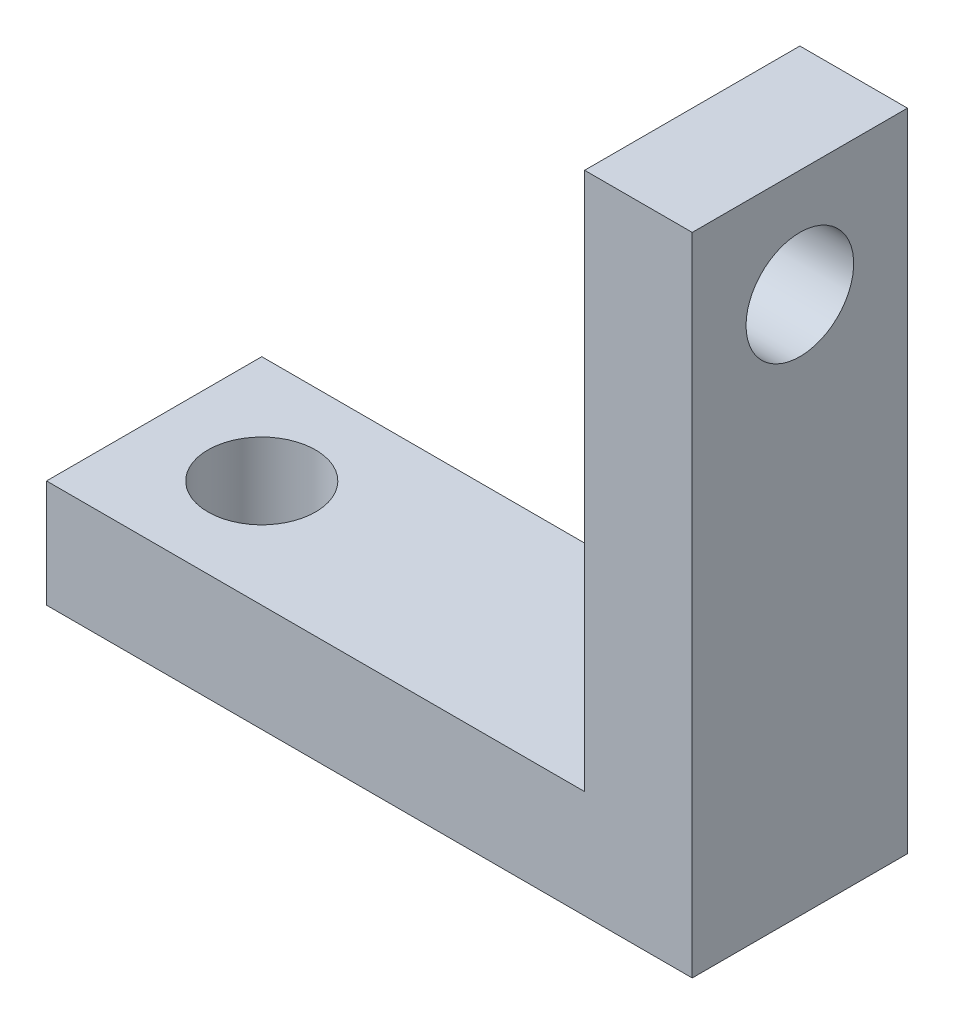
ISO-10303-21;
HEADER;
FILE_DESCRIPTION(('STEP AP214'),'2;1');
FILE_NAME('part.step','',(''),(''),'','','');
FILE_SCHEMA(('AUTOMOTIVE_DESIGN { 1 0 10303 214 1 1 1 1 }'));
ENDSEC;
DATA;
#1=APPLICATION_CONTEXT('core data for automotive mechanical design processes');
#2=APPLICATION_PROTOCOL_DEFINITION('international standard','automotive_design',2000,#1);
#3=PRODUCT_CONTEXT('',#1,'mechanical');
#4=PRODUCT('Part','Part','',(#3));
#5=PRODUCT_RELATED_PRODUCT_CATEGORY('part','',(#4));
#6=PRODUCT_DEFINITION_FORMATION('','',#4);
#7=PRODUCT_DEFINITION_CONTEXT('part definition',#1,'design');
#8=PRODUCT_DEFINITION('design','',#6,#7);
#9=PRODUCT_DEFINITION_SHAPE('','',#8);
#10=(LENGTH_UNIT() NAMED_UNIT(*) SI_UNIT(.MILLI.,.METRE.));
#11=(NAMED_UNIT(*) PLANE_ANGLE_UNIT() SI_UNIT($,.RADIAN.));
#12=(NAMED_UNIT(*) SI_UNIT($,.STERADIAN.) SOLID_ANGLE_UNIT());
#13=UNCERTAINTY_MEASURE_WITH_UNIT(LENGTH_MEASURE(1.E-05),#10,'distance_accuracy_value','');
#14=(GEOMETRIC_REPRESENTATION_CONTEXT(3) GLOBAL_UNCERTAINTY_ASSIGNED_CONTEXT((#13)) GLOBAL_UNIT_ASSIGNED_CONTEXT((#10,
#11,#12)) REPRESENTATION_CONTEXT('',''));
#15=CARTESIAN_POINT('',(0.,0.,0.));
#16=DIRECTION('',(0.,0.,1.));
#17=DIRECTION('',(1.,0.,0.));
#18=AXIS2_PLACEMENT_3D('',#15,#16,#17);
#19=CARTESIAN_POINT('',(-113.041016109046,-44.8276951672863,-38.1));
#20=DIRECTION('',(-1.,0.,0.));
#21=DIRECTION('',(0.,-1.,0.));
#22=AXIS2_PLACEMENT_3D('',#19,#20,#21);
#23=PLANE('',#22);
#24=DIRECTION('',(0.,-1.,0.));
#25=VECTOR('',#24,1.);
#26=CARTESIAN_POINT('',(-113.041016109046,-44.8276951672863,0.));
#27=LINE('',#26,#25);
#28=CARTESIAN_POINT('',(-113.041016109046,-44.8276951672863,0.));
#29=VERTEX_POINT('',#28);
#30=CARTESIAN_POINT('',(-113.041016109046,-63.8776951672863,0.));
#31=VERTEX_POINT('',#30);
#32=EDGE_CURVE('E401',#29,#31,#27,.T.);
#33=ORIENTED_EDGE('',*,*,#32,.F.);
#34=DIRECTION('',(0.,0.,1.));
#35=VECTOR('',#34,1.);
#36=CARTESIAN_POINT('',(-113.041016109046,-44.8276951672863,-38.1));
#37=LINE('',#36,#35);
#38=CARTESIAN_POINT('',(-113.041016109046,-44.8276951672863,-38.1));
#39=VERTEX_POINT('',#38);
#40=EDGE_CURVE('E11',#39,#29,#37,.T.);
#41=ORIENTED_EDGE('',*,*,#40,.F.);
#42=DIRECTION('',(0.,-1.,0.));
#43=VECTOR('',#42,1.);
#44=CARTESIAN_POINT('',(-113.041016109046,-44.8276951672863,-38.1));
#45=LINE('',#44,#43);
#46=CARTESIAN_POINT('',(-113.041016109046,-63.8776951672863,-38.1));
#47=VERTEX_POINT('',#46);
#48=EDGE_CURVE('E403',#39,#47,#45,.T.);
#49=ORIENTED_EDGE('',*,*,#48,.T.);
#50=DIRECTION('',(0.,0.,1.));
#51=VECTOR('',#50,1.);
#52=CARTESIAN_POINT('',(-113.041016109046,-63.8776951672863,-38.1));
#53=LINE('',#52,#51);
#54=EDGE_CURVE('E352',#47,#31,#53,.T.);
#55=ORIENTED_EDGE('',*,*,#54,.T.);
#56=EDGE_LOOP('',(#33,#41,#49,#55));
#57=FACE_BOUND('',#56,.T.);
#58=ADVANCED_FACE('F349',(#57),#23,.T.);
#59=CARTESIAN_POINT('',(-17.7910161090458,-44.8276951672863,-38.1));
#60=DIRECTION('',(0.,1.,0.));
#61=DIRECTION('',(-1.,0.,0.));
#62=AXIS2_PLACEMENT_3D('',#59,#60,#61);
#63=PLANE('',#62);
#64=CARTESIAN_POINT('',(-93.9910161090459,-44.8276951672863,-19.05));
#65=DIRECTION('',(0.,1.,0.));
#66=DIRECTION('',(0.,0.,1.));
#67=AXIS2_PLACEMENT_3D('',#64,#65,#66);
#68=CIRCLE('',#67,9.52500000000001);
#69=CARTESIAN_POINT('',(-93.9910161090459,-44.8276951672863,-9.52499999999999));
#70=VERTEX_POINT('',#69);
#71=EDGE_CURVE('E423',#70,#70,#68,.T.);
#72=ORIENTED_EDGE('',*,*,#71,.F.);
#73=EDGE_LOOP('',(#72));
#74=FACE_BOUND('',#73,.T.);
#75=DIRECTION('',(-1.,0.,0.));
#76=VECTOR('',#75,1.);
#77=CARTESIAN_POINT('',(-17.7910161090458,-44.8276951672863,0.));
#78=LINE('',#77,#76);
#79=CARTESIAN_POINT('',(-17.7910161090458,-44.8276951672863,0.));
#80=VERTEX_POINT('',#79);
#81=EDGE_CURVE('E419',#80,#29,#78,.T.);
#82=ORIENTED_EDGE('',*,*,#81,.F.);
#83=DIRECTION('',(0.,0.,1.));
#84=VECTOR('',#83,1.);
#85=CARTESIAN_POINT('',(-17.7910161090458,-44.8276951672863,-38.1));
#86=LINE('',#85,#84);
#87=CARTESIAN_POINT('',(-17.7910161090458,-44.8276951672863,-38.1));
#88=VERTEX_POINT('',#87);
#89=EDGE_CURVE('E357',#88,#80,#86,.T.);
#90=ORIENTED_EDGE('',*,*,#89,.F.);
#91=DIRECTION('',(-1.,0.,0.));
#92=VECTOR('',#91,1.);
#93=CARTESIAN_POINT('',(-17.7910161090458,-44.8276951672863,-38.1));
#94=LINE('',#93,#92);
#95=EDGE_CURVE('E408',#88,#39,#94,.T.);
#96=ORIENTED_EDGE('',*,*,#95,.T.);
#97=ORIENTED_EDGE('',*,*,#40,.T.);
#98=EDGE_LOOP('',(#82,#90,#96,#97));
#99=FACE_BOUND('',#98,.T.);
#100=ADVANCED_FACE('F459',(#74,#99),#63,.T.);
#101=CARTESIAN_POINT('',(-17.7910161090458,50.4223048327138,-38.1));
#102=DIRECTION('',(-1.,0.,0.));
#103=DIRECTION('',(0.,-1.,0.));
#104=AXIS2_PLACEMENT_3D('',#101,#102,#103);
#105=PLANE('',#104);
#106=CARTESIAN_POINT('',(-17.7910161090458,31.3723048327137,-19.05));
#107=DIRECTION('',(-1.,0.,0.));
#108=DIRECTION('',(0.,0.,1.));
#109=AXIS2_PLACEMENT_3D('',#106,#107,#108);
#110=CIRCLE('',#109,9.525);
#111=CARTESIAN_POINT('',(-17.7910161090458,31.3723048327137,-9.525));
#112=VERTEX_POINT('',#111);
#113=EDGE_CURVE('E533',#112,#112,#110,.T.);
#114=ORIENTED_EDGE('',*,*,#113,.F.);
#115=EDGE_LOOP('',(#114));
#116=FACE_BOUND('',#115,.T.);
#117=DIRECTION('',(0.,-1.,0.));
#118=VECTOR('',#117,1.);
#119=CARTESIAN_POINT('',(-17.7910161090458,50.4223048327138,0.));
#120=LINE('',#119,#118);
#121=CARTESIAN_POINT('',(-17.7910161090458,50.4223048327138,0.));
#122=VERTEX_POINT('',#121);
#123=EDGE_CURVE('E431',#122,#80,#120,.T.);
#124=ORIENTED_EDGE('',*,*,#123,.F.);
#125=DIRECTION('',(0.,0.,1.));
#126=VECTOR('',#125,1.);
#127=CARTESIAN_POINT('',(-17.7910161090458,50.4223048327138,-38.1));
#128=LINE('',#127,#126);
#129=CARTESIAN_POINT('',(-17.7910161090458,50.4223048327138,-38.1));
#130=VERTEX_POINT('',#129);
#131=EDGE_CURVE('E447',#130,#122,#128,.T.);
#132=ORIENTED_EDGE('',*,*,#131,.F.);
#133=DIRECTION('',(0.,-1.,0.));
#134=VECTOR('',#133,1.);
#135=CARTESIAN_POINT('',(-17.7910161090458,50.4223048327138,-38.1));
#136=LINE('',#135,#134);
#137=EDGE_CURVE('E443',#130,#88,#136,.T.);
#138=ORIENTED_EDGE('',*,*,#137,.T.);
#139=ORIENTED_EDGE('',*,*,#89,.T.);
#140=EDGE_LOOP('',(#124,#132,#138,#139));
#141=FACE_BOUND('',#140,.T.);
#142=ADVANCED_FACE('F464',(#116,#141),#105,.T.);
#143=CARTESIAN_POINT('',(1.25898389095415,50.4223048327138,-38.1));
#144=DIRECTION('',(0.,1.,0.));
#145=DIRECTION('',(-1.,0.,0.));
#146=AXIS2_PLACEMENT_3D('',#143,#144,#145);
#147=PLANE('',#146);
#148=DIRECTION('',(-1.,0.,0.));
#149=VECTOR('',#148,1.);
#150=CARTESIAN_POINT('',(1.25898389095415,50.4223048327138,0.));
#151=LINE('',#150,#149);
#152=CARTESIAN_POINT('',(1.25898389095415,50.4223048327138,0.));
#153=VERTEX_POINT('',#152);
#154=EDGE_CURVE('E428',#153,#122,#151,.T.);
#155=ORIENTED_EDGE('',*,*,#154,.F.);
#156=DIRECTION('',(0.,0.,1.));
#157=VECTOR('',#156,1.);
#158=CARTESIAN_POINT('',(1.25898389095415,50.4223048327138,-38.1));
#159=LINE('',#158,#157);
#160=CARTESIAN_POINT('',(1.25898389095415,50.4223048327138,-38.1));
#161=VERTEX_POINT('',#160);
#162=EDGE_CURVE('E449',#161,#153,#159,.T.);
#163=ORIENTED_EDGE('',*,*,#162,.F.);
#164=DIRECTION('',(-1.,0.,0.));
#165=VECTOR('',#164,1.);
#166=CARTESIAN_POINT('',(1.25898389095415,50.4223048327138,-38.1));
#167=LINE('',#166,#165);
#168=EDGE_CURVE('E440',#161,#130,#167,.T.);
#169=ORIENTED_EDGE('',*,*,#168,.T.);
#170=ORIENTED_EDGE('',*,*,#131,.T.);
#171=EDGE_LOOP('',(#155,#163,#169,#170));
#172=FACE_BOUND('',#171,.T.);
#173=ADVANCED_FACE('F456',(#172),#147,.T.);
#174=CARTESIAN_POINT('',(1.25898389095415,-63.8776951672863,-38.1));
#175=DIRECTION('',(1.,0.,0.));
#176=DIRECTION('',(0.,0.,-1.));
#177=AXIS2_PLACEMENT_3D('',#174,#175,#176);
#178=PLANE('',#177);
#179=CARTESIAN_POINT('',(1.25898389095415,31.3723048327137,-19.05));
#180=DIRECTION('',(-1.,0.,0.));
#181=DIRECTION('',(0.,0.,1.));
#182=AXIS2_PLACEMENT_3D('',#179,#180,#181);
#183=CIRCLE('',#182,9.525);
#184=CARTESIAN_POINT('',(1.25898389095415,31.3723048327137,-9.525));
#185=VERTEX_POINT('',#184);
#186=EDGE_CURVE('E532',#185,#185,#183,.T.);
#187=ORIENTED_EDGE('',*,*,#186,.T.);
#188=EDGE_LOOP('',(#187));
#189=FACE_BOUND('',#188,.T.);
#190=DIRECTION('',(0.,1.,0.));
#191=VECTOR('',#190,1.);
#192=CARTESIAN_POINT('',(1.25898389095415,-63.8776951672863,0.));
#193=LINE('',#192,#191);
#194=CARTESIAN_POINT('',(1.25898389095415,-63.8776951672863,0.));
#195=VERTEX_POINT('',#194);
#196=EDGE_CURVE('E415',#195,#153,#193,.T.);
#197=ORIENTED_EDGE('',*,*,#196,.F.);
#198=DIRECTION('',(0.,0.,1.));
#199=VECTOR('',#198,1.);
#200=CARTESIAN_POINT('',(1.25898389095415,-63.8776951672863,-38.1));
#201=LINE('',#200,#199);
#202=CARTESIAN_POINT('',(1.25898389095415,-63.8776951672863,-38.1));
#203=VERTEX_POINT('',#202);
#204=EDGE_CURVE('E407',#203,#195,#201,.T.);
#205=ORIENTED_EDGE('',*,*,#204,.F.);
#206=DIRECTION('',(0.,1.,0.));
#207=VECTOR('',#206,1.);
#208=CARTESIAN_POINT('',(1.25898389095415,-63.8776951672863,-38.1));
#209=LINE('',#208,#207);
#210=EDGE_CURVE('E437',#203,#161,#209,.T.);
#211=ORIENTED_EDGE('',*,*,#210,.T.);
#212=ORIENTED_EDGE('',*,*,#162,.T.);
#213=EDGE_LOOP('',(#197,#205,#211,#212));
#214=FACE_BOUND('',#213,.T.);
#215=ADVANCED_FACE('F452',(#189,#214),#178,.T.);
#216=CARTESIAN_POINT('',(-113.041016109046,-63.8776951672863,-38.1));
#217=DIRECTION('',(0.,-1.,0.));
#218=DIRECTION('',(0.,0.,-1.));
#219=AXIS2_PLACEMENT_3D('',#216,#217,#218);
#220=PLANE('',#219);
#221=CARTESIAN_POINT('',(-93.9910161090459,-63.8776951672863,-19.05));
#222=DIRECTION('',(0.,1.,0.));
#223=DIRECTION('',(0.,0.,1.));
#224=AXIS2_PLACEMENT_3D('',#221,#222,#223);
#225=CIRCLE('',#224,9.52500000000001);
#226=CARTESIAN_POINT('',(-93.9910161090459,-63.8776951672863,-9.52499999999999));
#227=VERTEX_POINT('',#226);
#228=EDGE_CURVE('E420',#227,#227,#225,.T.);
#229=ORIENTED_EDGE('',*,*,#228,.T.);
#230=EDGE_LOOP('',(#229));
#231=FACE_BOUND('',#230,.T.);
#232=DIRECTION('',(1.,0.,0.));
#233=VECTOR('',#232,1.);
#234=CARTESIAN_POINT('',(-113.041016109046,-63.8776951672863,0.));
#235=LINE('',#234,#233);
#236=EDGE_CURVE('E410',#31,#195,#235,.T.);
#237=ORIENTED_EDGE('',*,*,#236,.F.);
#238=ORIENTED_EDGE('',*,*,#54,.F.);
#239=DIRECTION('',(1.,0.,0.));
#240=VECTOR('',#239,1.);
#241=CARTESIAN_POINT('',(-113.041016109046,-63.8776951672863,-38.1));
#242=LINE('',#241,#240);
#243=EDGE_CURVE('E435',#47,#203,#242,.T.);
#244=ORIENTED_EDGE('',*,*,#243,.T.);
#245=ORIENTED_EDGE('',*,*,#204,.T.);
#246=EDGE_LOOP('',(#237,#238,#244,#245));
#247=FACE_BOUND('',#246,.T.);
#248=ADVANCED_FACE('F411',(#231,#247),#220,.T.);
#249=CARTESIAN_POINT('',(-113.041016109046,50.4223048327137,-38.1));
#250=DIRECTION('',(0.,0.,-1.));
#251=DIRECTION('',(-1.,0.,0.));
#252=AXIS2_PLACEMENT_3D('',#249,#250,#251);
#253=PLANE('',#252);
#254=ORIENTED_EDGE('',*,*,#48,.F.);
#255=ORIENTED_EDGE('',*,*,#95,.F.);
#256=ORIENTED_EDGE('',*,*,#137,.F.);
#257=ORIENTED_EDGE('',*,*,#168,.F.);
#258=ORIENTED_EDGE('',*,*,#210,.F.);
#259=ORIENTED_EDGE('',*,*,#243,.F.);
#260=EDGE_LOOP('',(#254,#255,#256,#257,#258,#259));
#261=FACE_BOUND('',#260,.T.);
#262=ADVANCED_FACE('F463',(#261),#253,.T.);
#263=CARTESIAN_POINT('',(-113.041016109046,50.4223048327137,0.));
#264=DIRECTION('',(0.,0.,-1.));
#265=DIRECTION('',(-1.,0.,0.));
#266=AXIS2_PLACEMENT_3D('',#263,#264,#265);
#267=PLANE('',#266);
#268=ORIENTED_EDGE('',*,*,#32,.T.);
#269=ORIENTED_EDGE('',*,*,#236,.T.);
#270=ORIENTED_EDGE('',*,*,#196,.T.);
#271=ORIENTED_EDGE('',*,*,#154,.T.);
#272=ORIENTED_EDGE('',*,*,#123,.T.);
#273=ORIENTED_EDGE('',*,*,#81,.T.);
#274=EDGE_LOOP('',(#268,#269,#270,#271,#272,#273));
#275=FACE_BOUND('',#274,.T.);
#276=ADVANCED_FACE('F417',(#275),#267,.F.);
#277=CARTESIAN_POINT('',(-93.9910161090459,-63.8776951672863,-19.05));
#278=DIRECTION('',(0.,1.,0.));
#279=DIRECTION('',(0.,0.,1.));
#280=AXIS2_PLACEMENT_3D('',#277,#278,#279);
#281=CYLINDRICAL_SURFACE('',#280,9.52500000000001);
#282=ORIENTED_EDGE('',*,*,#228,.F.);
#283=EDGE_LOOP('',(#282));
#284=FACE_BOUND('',#283,.T.);
#285=ORIENTED_EDGE('',*,*,#71,.T.);
#286=EDGE_LOOP('',(#285));
#287=FACE_BOUND('',#286,.T.);
#288=ADVANCED_FACE('F499',(#284,#287),#281,.F.);
#289=CARTESIAN_POINT('',(1.25898389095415,31.3723048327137,-19.05));
#290=DIRECTION('',(-1.,0.,0.));
#291=DIRECTION('',(0.,0.,1.));
#292=AXIS2_PLACEMENT_3D('',#289,#290,#291);
#293=CYLINDRICAL_SURFACE('',#292,9.525);
#294=ORIENTED_EDGE('',*,*,#186,.F.);
#295=EDGE_LOOP('',(#294));
#296=FACE_BOUND('',#295,.T.);
#297=ORIENTED_EDGE('',*,*,#113,.T.);
#298=EDGE_LOOP('',(#297));
#299=FACE_BOUND('',#298,.T.);
#300=ADVANCED_FACE('F513',(#296,#299),#293,.F.);
#301=CLOSED_SHELL('',(#58,#100,#142,#173,#215,#248,#262,#276,#288,#300));
#302=MANIFOLD_SOLID_BREP('B2',#301);
#303=ADVANCED_BREP_SHAPE_REPRESENTATION('',(#18,#302),#14);
#304=SHAPE_DEFINITION_REPRESENTATION(#9,#303);
ENDSEC;
END-ISO-10303-21;
